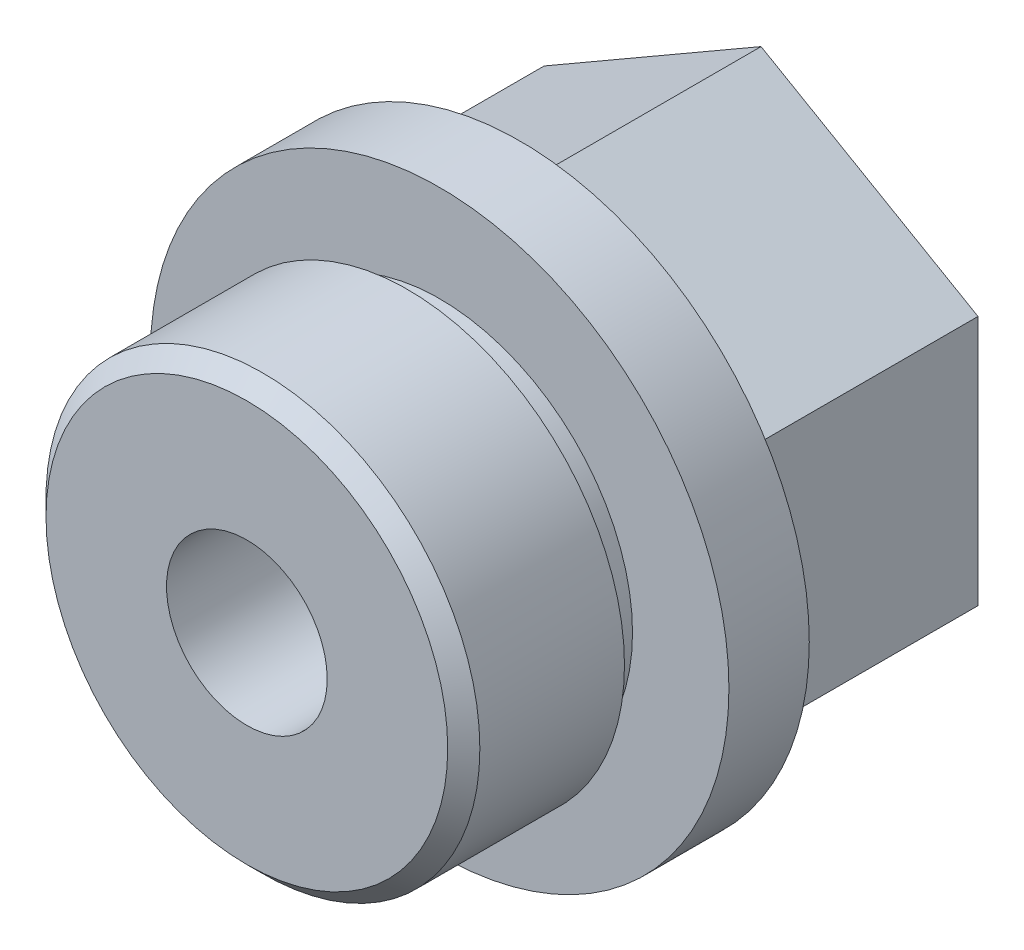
ISO-10303-21;
HEADER;
FILE_DESCRIPTION(('STEP AP214'),'2;1');
FILE_NAME('part.step','',(''),(''),'','','');
FILE_SCHEMA(('AUTOMOTIVE_DESIGN { 1 0 10303 214 1 1 1 1 }'));
ENDSEC;
DATA;
#1=APPLICATION_CONTEXT('core data for automotive mechanical design processes');
#2=APPLICATION_PROTOCOL_DEFINITION('international standard','automotive_design',2000,#1);
#3=PRODUCT_CONTEXT('',#1,'mechanical');
#4=PRODUCT('Part','Part','',(#3));
#5=PRODUCT_RELATED_PRODUCT_CATEGORY('part','',(#4));
#6=PRODUCT_DEFINITION_FORMATION('','',#4);
#7=PRODUCT_DEFINITION_CONTEXT('part definition',#1,'design');
#8=PRODUCT_DEFINITION('design','',#6,#7);
#9=PRODUCT_DEFINITION_SHAPE('','',#8);
#10=(LENGTH_UNIT() NAMED_UNIT(*) SI_UNIT(.MILLI.,.METRE.));
#11=(NAMED_UNIT(*) PLANE_ANGLE_UNIT() SI_UNIT($,.RADIAN.));
#12=(NAMED_UNIT(*) SI_UNIT($,.STERADIAN.) SOLID_ANGLE_UNIT());
#13=UNCERTAINTY_MEASURE_WITH_UNIT(LENGTH_MEASURE(1.E-05),#10,'distance_accuracy_value','');
#14=(GEOMETRIC_REPRESENTATION_CONTEXT(3) GLOBAL_UNCERTAINTY_ASSIGNED_CONTEXT((#13)) GLOBAL_UNIT_ASSIGNED_CONTEXT((#10,
#11,#12)) REPRESENTATION_CONTEXT('',''));
#15=CARTESIAN_POINT('',(0.,0.,0.));
#16=DIRECTION('',(0.,0.,1.));
#17=DIRECTION('',(1.,0.,0.));
#18=AXIS2_PLACEMENT_3D('',#15,#16,#17);
#19=CARTESIAN_POINT('',(0.,0.,32.));
#20=DIRECTION('',(0.,0.,1.));
#21=DIRECTION('',(1.,0.,0.));
#22=AXIS2_PLACEMENT_3D('',#19,#20,#21);
#23=PLANE('',#22);
#24=CARTESIAN_POINT('',(0.,0.,32.));
#25=DIRECTION('',(0.,0.,1.));
#26=DIRECTION('',(1.,0.,0.));
#27=AXIS2_PLACEMENT_3D('',#24,#25,#26);
#28=CIRCLE('',#27,12.5);
#29=CARTESIAN_POINT('',(12.5,0.,32.));
#30=VERTEX_POINT('',#29);
#31=EDGE_CURVE('E44',#30,#30,#28,.T.);
#32=ORIENTED_EDGE('',*,*,#31,.T.);
#33=EDGE_LOOP('',(#32));
#34=FACE_BOUND('',#33,.T.);
#35=CARTESIAN_POINT('',(0.,0.,32.));
#36=DIRECTION('',(0.,0.,1.));
#37=DIRECTION('',(1.,0.,0.));
#38=AXIS2_PLACEMENT_3D('',#35,#36,#37);
#39=CIRCLE('',#38,5.);
#40=CARTESIAN_POINT('',(5.,0.,32.));
#41=VERTEX_POINT('',#40);
#42=EDGE_CURVE('E39',#41,#41,#39,.F.);
#43=ORIENTED_EDGE('',*,*,#42,.T.);
#44=EDGE_LOOP('',(#43));
#45=FACE_BOUND('',#44,.T.);
#46=ADVANCED_FACE('F35',(#34,#45),#23,.T.);
#47=CARTESIAN_POINT('',(0.,0.,20.));
#48=DIRECTION('',(0.,0.,1.));
#49=DIRECTION('',(1.,0.,0.));
#50=AXIS2_PLACEMENT_3D('',#47,#48,#49);
#51=PLANE('',#50);
#52=CARTESIAN_POINT('',(0.,0.,20.));
#53=DIRECTION('',(0.,0.,1.));
#54=DIRECTION('',(1.,0.,0.));
#55=AXIS2_PLACEMENT_3D('',#52,#53,#54);
#56=CIRCLE('',#55,18.);
#57=CARTESIAN_POINT('',(18.,0.,20.));
#58=VERTEX_POINT('',#57);
#59=EDGE_CURVE('E217',#58,#58,#56,.T.);
#60=ORIENTED_EDGE('',*,*,#59,.T.);
#61=EDGE_LOOP('',(#60));
#62=FACE_BOUND('',#61,.T.);
#63=CARTESIAN_POINT('',(0.,0.,20.));
#64=DIRECTION('',(0.,0.,1.));
#65=DIRECTION('',(1.,0.,0.));
#66=AXIS2_PLACEMENT_3D('',#63,#64,#65);
#67=CIRCLE('',#66,12.);
#68=CARTESIAN_POINT('',(12.,0.,20.));
#69=VERTEX_POINT('',#68);
#70=EDGE_CURVE('E227',#69,#69,#67,.T.);
#71=ORIENTED_EDGE('',*,*,#70,.F.);
#72=EDGE_LOOP('',(#71));
#73=FACE_BOUND('',#72,.T.);
#74=ADVANCED_FACE('F108',(#62,#73),#51,.T.);
#75=CARTESIAN_POINT('',(-13.5,-7.79422863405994,15.));
#76=DIRECTION('',(0.5,0.866025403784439,0.));
#77=DIRECTION('',(-0.866025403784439,0.5,0.));
#78=AXIS2_PLACEMENT_3D('',#75,#76,#77);
#79=PLANE('',#78);
#80=DIRECTION('',(0.866025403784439,-0.5,0.));
#81=VECTOR('',#80,1.);
#82=CARTESIAN_POINT('',(-13.5,-7.79422863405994,0.));
#83=LINE('',#82,#81);
#84=CARTESIAN_POINT('',(-13.5,-7.79422863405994,0.));
#85=VERTEX_POINT('',#84);
#86=CARTESIAN_POINT('',(0.,-15.5884572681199,0.));
#87=VERTEX_POINT('',#86);
#88=EDGE_CURVE('E171',#85,#87,#83,.T.);
#89=ORIENTED_EDGE('',*,*,#88,.T.);
#90=DIRECTION('',(0.,0.,-1.));
#91=VECTOR('',#90,1.);
#92=CARTESIAN_POINT('',(0.,-15.5884572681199,15.));
#93=LINE('',#92,#91);
#94=CARTESIAN_POINT('',(0.,-15.5884572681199,15.));
#95=VERTEX_POINT('',#94);
#96=EDGE_CURVE('E166',#95,#87,#93,.T.);
#97=ORIENTED_EDGE('',*,*,#96,.F.);
#98=DIRECTION('',(0.866025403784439,-0.5,0.));
#99=VECTOR('',#98,1.);
#100=CARTESIAN_POINT('',(-13.5,-7.79422863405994,15.));
#101=LINE('',#100,#99);
#102=CARTESIAN_POINT('',(-13.5,-7.79422863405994,15.));
#103=VERTEX_POINT('',#102);
#104=EDGE_CURVE('E190',#103,#95,#101,.T.);
#105=ORIENTED_EDGE('',*,*,#104,.F.);
#106=DIRECTION('',(0.,0.,-1.));
#107=VECTOR('',#106,1.);
#108=CARTESIAN_POINT('',(-13.5,-7.79422863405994,15.));
#109=LINE('',#108,#107);
#110=EDGE_CURVE('E205',#103,#85,#109,.T.);
#111=ORIENTED_EDGE('',*,*,#110,.T.);
#112=EDGE_LOOP('',(#89,#97,#105,#111));
#113=FACE_BOUND('',#112,.T.);
#114=ADVANCED_FACE('F37',(#113),#79,.F.);
#115=CARTESIAN_POINT('',(0.,-15.5884572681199,15.));
#116=DIRECTION('',(-0.5,0.866025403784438,0.));
#117=DIRECTION('',(-0.866025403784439,-0.5,0.));
#118=AXIS2_PLACEMENT_3D('',#115,#116,#117);
#119=PLANE('',#118);
#120=DIRECTION('',(0.866025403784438,0.5,0.));
#121=VECTOR('',#120,1.);
#122=CARTESIAN_POINT('',(0.,-15.5884572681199,0.));
#123=LINE('',#122,#121);
#124=CARTESIAN_POINT('',(13.5,-7.79422863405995,0.));
#125=VERTEX_POINT('',#124);
#126=EDGE_CURVE('E161',#87,#125,#123,.T.);
#127=ORIENTED_EDGE('',*,*,#126,.T.);
#128=DIRECTION('',(0.,0.,-1.));
#129=VECTOR('',#128,1.);
#130=CARTESIAN_POINT('',(13.5,-7.79422863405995,15.));
#131=LINE('',#130,#129);
#132=CARTESIAN_POINT('',(13.5,-7.79422863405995,15.));
#133=VERTEX_POINT('',#132);
#134=EDGE_CURVE('E163',#133,#125,#131,.T.);
#135=ORIENTED_EDGE('',*,*,#134,.F.);
#136=DIRECTION('',(0.866025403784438,0.5,0.));
#137=VECTOR('',#136,1.);
#138=CARTESIAN_POINT('',(0.,-15.5884572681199,15.));
#139=LINE('',#138,#137);
#140=EDGE_CURVE('E193',#95,#133,#139,.T.);
#141=ORIENTED_EDGE('',*,*,#140,.F.);
#142=ORIENTED_EDGE('',*,*,#96,.T.);
#143=EDGE_LOOP('',(#127,#135,#141,#142));
#144=FACE_BOUND('',#143,.T.);
#145=ADVANCED_FACE('F152',(#144),#119,.F.);
#146=CARTESIAN_POINT('',(13.5,-7.79422863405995,15.));
#147=DIRECTION('',(-1.,0.,0.));
#148=DIRECTION('',(0.,0.,1.));
#149=AXIS2_PLACEMENT_3D('',#146,#147,#148);
#150=PLANE('',#149);
#151=DIRECTION('',(0.,1.,0.));
#152=VECTOR('',#151,1.);
#153=CARTESIAN_POINT('',(13.5,-7.79422863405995,0.));
#154=LINE('',#153,#152);
#155=CARTESIAN_POINT('',(13.5,7.79422863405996,0.));
#156=VERTEX_POINT('',#155);
#157=EDGE_CURVE('E170',#125,#156,#154,.T.);
#158=ORIENTED_EDGE('',*,*,#157,.T.);
#159=DIRECTION('',(0.,0.,-1.));
#160=VECTOR('',#159,1.);
#161=CARTESIAN_POINT('',(13.5,7.79422863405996,15.));
#162=LINE('',#161,#160);
#163=CARTESIAN_POINT('',(13.5,7.79422863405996,15.));
#164=VERTEX_POINT('',#163);
#165=EDGE_CURVE('E177',#164,#156,#162,.T.);
#166=ORIENTED_EDGE('',*,*,#165,.F.);
#167=DIRECTION('',(0.,1.,0.));
#168=VECTOR('',#167,1.);
#169=CARTESIAN_POINT('',(13.5,-7.79422863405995,15.));
#170=LINE('',#169,#168);
#171=EDGE_CURVE('E175',#133,#164,#170,.T.);
#172=ORIENTED_EDGE('',*,*,#171,.F.);
#173=ORIENTED_EDGE('',*,*,#134,.T.);
#174=EDGE_LOOP('',(#158,#166,#172,#173));
#175=FACE_BOUND('',#174,.T.);
#176=ADVANCED_FACE('F150',(#175),#150,.F.);
#177=CARTESIAN_POINT('',(13.5,7.79422863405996,15.));
#178=DIRECTION('',(-0.5,-0.866025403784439,0.));
#179=DIRECTION('',(0.866025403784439,-0.5,0.));
#180=AXIS2_PLACEMENT_3D('',#177,#178,#179);
#181=PLANE('',#180);
#182=DIRECTION('',(-0.866025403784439,0.5,0.));
#183=VECTOR('',#182,1.);
#184=CARTESIAN_POINT('',(13.5,7.79422863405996,0.));
#185=LINE('',#184,#183);
#186=CARTESIAN_POINT('',(0.,15.5884572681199,0.));
#187=VERTEX_POINT('',#186);
#188=EDGE_CURVE('E181',#156,#187,#185,.T.);
#189=ORIENTED_EDGE('',*,*,#188,.T.);
#190=DIRECTION('',(0.,0.,-1.));
#191=VECTOR('',#190,1.);
#192=CARTESIAN_POINT('',(0.,15.5884572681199,15.));
#193=LINE('',#192,#191);
#194=CARTESIAN_POINT('',(0.,15.5884572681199,15.));
#195=VERTEX_POINT('',#194);
#196=EDGE_CURVE('E59',#195,#187,#193,.T.);
#197=ORIENTED_EDGE('',*,*,#196,.F.);
#198=DIRECTION('',(-0.866025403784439,0.5,0.));
#199=VECTOR('',#198,1.);
#200=CARTESIAN_POINT('',(13.5,7.79422863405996,15.));
#201=LINE('',#200,#199);
#202=EDGE_CURVE('E196',#164,#195,#201,.T.);
#203=ORIENTED_EDGE('',*,*,#202,.F.);
#204=ORIENTED_EDGE('',*,*,#165,.T.);
#205=EDGE_LOOP('',(#189,#197,#203,#204));
#206=FACE_BOUND('',#205,.T.);
#207=ADVANCED_FACE('F147',(#206),#181,.F.);
#208=CARTESIAN_POINT('',(0.,15.5884572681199,15.));
#209=DIRECTION('',(0.5,-0.866025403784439,0.));
#210=DIRECTION('',(0.866025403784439,0.5,0.));
#211=AXIS2_PLACEMENT_3D('',#208,#209,#210);
#212=PLANE('',#211);
#213=DIRECTION('',(-0.866025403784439,-0.5,0.));
#214=VECTOR('',#213,1.);
#215=CARTESIAN_POINT('',(0.,15.5884572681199,0.));
#216=LINE('',#215,#214);
#217=CARTESIAN_POINT('',(-13.5,7.79422863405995,0.));
#218=VERTEX_POINT('',#217);
#219=EDGE_CURVE('E183',#187,#218,#216,.T.);
#220=ORIENTED_EDGE('',*,*,#219,.T.);
#221=DIRECTION('',(0.,0.,-1.));
#222=VECTOR('',#221,1.);
#223=CARTESIAN_POINT('',(-13.5,7.79422863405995,15.));
#224=LINE('',#223,#222);
#225=CARTESIAN_POINT('',(-13.5,7.79422863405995,15.));
#226=VERTEX_POINT('',#225);
#227=EDGE_CURVE('E51',#226,#218,#224,.T.);
#228=ORIENTED_EDGE('',*,*,#227,.F.);
#229=DIRECTION('',(-0.866025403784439,-0.5,0.));
#230=VECTOR('',#229,1.);
#231=CARTESIAN_POINT('',(0.,15.5884572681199,15.));
#232=LINE('',#231,#230);
#233=EDGE_CURVE('E199',#195,#226,#232,.T.);
#234=ORIENTED_EDGE('',*,*,#233,.F.);
#235=ORIENTED_EDGE('',*,*,#196,.T.);
#236=EDGE_LOOP('',(#220,#228,#234,#235));
#237=FACE_BOUND('',#236,.T.);
#238=ADVANCED_FACE('F143',(#237),#212,.F.);
#239=CARTESIAN_POINT('',(-13.5,7.79422863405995,15.));
#240=DIRECTION('',(1.,0.,0.));
#241=DIRECTION('',(0.,0.,-1.));
#242=AXIS2_PLACEMENT_3D('',#239,#240,#241);
#243=PLANE('',#242);
#244=DIRECTION('',(0.,-1.,0.));
#245=VECTOR('',#244,1.);
#246=CARTESIAN_POINT('',(-13.5,7.79422863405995,0.));
#247=LINE('',#246,#245);
#248=EDGE_CURVE('E188',#218,#85,#247,.T.);
#249=ORIENTED_EDGE('',*,*,#248,.T.);
#250=ORIENTED_EDGE('',*,*,#110,.F.);
#251=DIRECTION('',(0.,-1.,0.));
#252=VECTOR('',#251,1.);
#253=CARTESIAN_POINT('',(-13.5,7.79422863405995,15.));
#254=LINE('',#253,#252);
#255=EDGE_CURVE('E202',#226,#103,#254,.T.);
#256=ORIENTED_EDGE('',*,*,#255,.F.);
#257=ORIENTED_EDGE('',*,*,#227,.T.);
#258=EDGE_LOOP('',(#249,#250,#256,#257));
#259=FACE_BOUND('',#258,.T.);
#260=ADVANCED_FACE('F139',(#259),#243,.F.);
#261=CARTESIAN_POINT('',(0.,-15.5884572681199,0.));
#262=DIRECTION('',(0.,0.,1.));
#263=DIRECTION('',(1.,0.,0.));
#264=AXIS2_PLACEMENT_3D('',#261,#262,#263);
#265=PLANE('',#264);
#266=ORIENTED_EDGE('',*,*,#88,.F.);
#267=ORIENTED_EDGE('',*,*,#248,.F.);
#268=ORIENTED_EDGE('',*,*,#219,.F.);
#269=ORIENTED_EDGE('',*,*,#188,.F.);
#270=ORIENTED_EDGE('',*,*,#157,.F.);
#271=ORIENTED_EDGE('',*,*,#126,.F.);
#272=EDGE_LOOP('',(#266,#267,#268,#269,#270,#271));
#273=FACE_BOUND('',#272,.T.);
#274=ADVANCED_FACE('F131',(#273),#265,.F.);
#275=CARTESIAN_POINT('',(0.,0.,15.));
#276=DIRECTION('',(0.,0.,1.));
#277=DIRECTION('',(1.,0.,0.));
#278=AXIS2_PLACEMENT_3D('',#275,#276,#277);
#279=PLANE('',#278);
#280=CARTESIAN_POINT('',(0.,0.,15.));
#281=DIRECTION('',(0.,0.,1.));
#282=DIRECTION('',(1.,0.,0.));
#283=AXIS2_PLACEMENT_3D('',#280,#281,#282);
#284=CIRCLE('',#283,18.);
#285=CARTESIAN_POINT('',(18.,0.,15.));
#286=VERTEX_POINT('',#285);
#287=EDGE_CURVE('E219',#286,#286,#284,.T.);
#288=ORIENTED_EDGE('',*,*,#287,.F.);
#289=EDGE_LOOP('',(#288));
#290=FACE_BOUND('',#289,.T.);
#291=ORIENTED_EDGE('',*,*,#255,.T.);
#292=ORIENTED_EDGE('',*,*,#104,.T.);
#293=ORIENTED_EDGE('',*,*,#140,.T.);
#294=ORIENTED_EDGE('',*,*,#171,.T.);
#295=ORIENTED_EDGE('',*,*,#202,.T.);
#296=ORIENTED_EDGE('',*,*,#233,.T.);
#297=EDGE_LOOP('',(#291,#292,#293,#294,#295,#296));
#298=FACE_BOUND('',#297,.T.);
#299=ADVANCED_FACE('F129',(#290,#298),#279,.F.);
#300=CARTESIAN_POINT('',(0.,0.,20.));
#301=DIRECTION('',(0.,0.,-1.));
#302=DIRECTION('',(-1.,0.,0.));
#303=AXIS2_PLACEMENT_3D('',#300,#301,#302);
#304=CYLINDRICAL_SURFACE('',#303,18.);
#305=ORIENTED_EDGE('',*,*,#59,.F.);
#306=EDGE_LOOP('',(#305));
#307=FACE_BOUND('',#306,.T.);
#308=ORIENTED_EDGE('',*,*,#287,.T.);
#309=EDGE_LOOP('',(#308));
#310=FACE_BOUND('',#309,.T.);
#311=ADVANCED_FACE('F127',(#307,#310),#304,.T.);
#312=CARTESIAN_POINT('',(0.,0.,22.));
#313=DIRECTION('',(0.,0.,-1.));
#314=DIRECTION('',(-1.,0.,0.));
#315=AXIS2_PLACEMENT_3D('',#312,#313,#314);
#316=CYLINDRICAL_SURFACE('',#315,12.);
#317=CARTESIAN_POINT('',(0.,0.,22.));
#318=DIRECTION('',(0.,0.,1.));
#319=DIRECTION('',(1.,0.,0.));
#320=AXIS2_PLACEMENT_3D('',#317,#318,#319);
#321=CIRCLE('',#320,12.);
#322=CARTESIAN_POINT('',(12.,0.,22.));
#323=VERTEX_POINT('',#322);
#324=EDGE_CURVE('E224',#323,#323,#321,.T.);
#325=ORIENTED_EDGE('',*,*,#324,.F.);
#326=EDGE_LOOP('',(#325));
#327=FACE_BOUND('',#326,.T.);
#328=ORIENTED_EDGE('',*,*,#70,.T.);
#329=EDGE_LOOP('',(#328));
#330=FACE_BOUND('',#329,.T.);
#331=ADVANCED_FACE('F124',(#327,#330),#316,.T.);
#332=CARTESIAN_POINT('',(0.,0.,22.));
#333=DIRECTION('',(0.,0.,1.));
#334=DIRECTION('',(1.,0.,0.));
#335=AXIS2_PLACEMENT_3D('',#332,#333,#334);
#336=PLANE('',#335);
#337=CARTESIAN_POINT('',(0.,0.,22.));
#338=DIRECTION('',(0.,0.,1.));
#339=DIRECTION('',(1.,0.,0.));
#340=AXIS2_PLACEMENT_3D('',#337,#338,#339);
#341=CIRCLE('',#340,13.5);
#342=CARTESIAN_POINT('',(13.5,0.,22.));
#343=VERTEX_POINT('',#342);
#344=EDGE_CURVE('E230',#343,#343,#341,.T.);
#345=ORIENTED_EDGE('',*,*,#344,.F.);
#346=EDGE_LOOP('',(#345));
#347=FACE_BOUND('',#346,.T.);
#348=ORIENTED_EDGE('',*,*,#324,.T.);
#349=EDGE_LOOP('',(#348));
#350=FACE_BOUND('',#349,.T.);
#351=ADVANCED_FACE('F120',(#347,#350),#336,.F.);
#352=CARTESIAN_POINT('',(0.,0.,32.));
#353=DIRECTION('',(0.,0.,-1.));
#354=DIRECTION('',(-1.,0.,0.));
#355=AXIS2_PLACEMENT_3D('',#352,#353,#354);
#356=CYLINDRICAL_SURFACE('',#355,13.5);
#357=CARTESIAN_POINT('',(0.,0.,31.));
#358=DIRECTION('',(0.,0.,1.));
#359=DIRECTION('',(1.,0.,0.));
#360=AXIS2_PLACEMENT_3D('',#357,#358,#359);
#361=CIRCLE('',#360,13.5);
#362=CARTESIAN_POINT('',(13.5,0.,31.));
#363=VERTEX_POINT('',#362);
#364=EDGE_CURVE('E11',#363,#363,#361,.F.);
#365=ORIENTED_EDGE('',*,*,#364,.T.);
#366=EDGE_LOOP('',(#365));
#367=FACE_BOUND('',#366,.T.);
#368=ORIENTED_EDGE('',*,*,#344,.T.);
#369=EDGE_LOOP('',(#368));
#370=FACE_BOUND('',#369,.T.);
#371=ADVANCED_FACE('F103',(#367,#370),#356,.T.);
#372=CARTESIAN_POINT('',(0.,0.,32.));
#373=DIRECTION('',(0.,0.,-1.));
#374=DIRECTION('',(-1.,0.,0.));
#375=AXIS2_PLACEMENT_3D('',#372,#373,#374);
#376=CONICAL_SURFACE('',#375,12.5,0.785398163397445);
#377=ORIENTED_EDGE('',*,*,#364,.F.);
#378=EDGE_LOOP('',(#377));
#379=FACE_BOUND('',#378,.T.);
#380=ORIENTED_EDGE('',*,*,#31,.F.);
#381=EDGE_LOOP('',(#380));
#382=FACE_BOUND('',#381,.T.);
#383=ADVANCED_FACE('F94',(#379,#382),#376,.T.);
#384=CARTESIAN_POINT('',(0.,0.,9.11324865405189));
#385=DIRECTION('',(0.,0.,1.));
#386=DIRECTION('',(1.,0.,0.));
#387=AXIS2_PLACEMENT_3D('',#384,#385,#386);
#388=CONICAL_SURFACE('',#387,0.,1.0471975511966);
#389=CARTESIAN_POINT('',(0.,0.,12.));
#390=DIRECTION('',(0.,0.,1.));
#391=DIRECTION('',(1.,0.,0.));
#392=AXIS2_PLACEMENT_3D('',#389,#390,#391);
#393=CIRCLE('',#392,5.);
#394=CARTESIAN_POINT('',(5.,0.,12.));
#395=VERTEX_POINT('',#394);
#396=EDGE_CURVE('E233',#395,#395,#393,.T.);
#397=ORIENTED_EDGE('',*,*,#396,.T.);
#398=EDGE_LOOP('',(#397));
#399=FACE_BOUND('',#398,.T.);
#400=CARTESIAN_POINT('',(0.,0.,9.11324865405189));
#401=VERTEX_POINT('',#400);
#402=VERTEX_LOOP('',#401);
#403=FACE_BOUND('',#402,.T.);
#404=ADVANCED_FACE('F91',(#399,#403),#388,.F.);
#405=CARTESIAN_POINT('',(0.,0.,38.7764705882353));
#406=DIRECTION('',(0.,0.,1.));
#407=DIRECTION('',(1.,0.,0.));
#408=AXIS2_PLACEMENT_3D('',#405,#406,#407);
#409=CYLINDRICAL_SURFACE('',#408,5.);
#410=ORIENTED_EDGE('',*,*,#42,.F.);
#411=EDGE_LOOP('',(#410));
#412=FACE_BOUND('',#411,.T.);
#413=ORIENTED_EDGE('',*,*,#396,.F.);
#414=EDGE_LOOP('',(#413));
#415=FACE_BOUND('',#414,.T.);
#416=ADVANCED_FACE('F93',(#412,#415),#409,.F.);
#417=CLOSED_SHELL('',(#46,#74,#114,#145,#176,#207,#238,#260,#274,#299,#311,#331,#351,#371,#383,
#404,#416));
#418=MANIFOLD_SOLID_BREP('B2',#417);
#419=ADVANCED_BREP_SHAPE_REPRESENTATION('',(#18,#418),#14);
#420=SHAPE_DEFINITION_REPRESENTATION(#9,#419);
ENDSEC;
END-ISO-10303-21;
